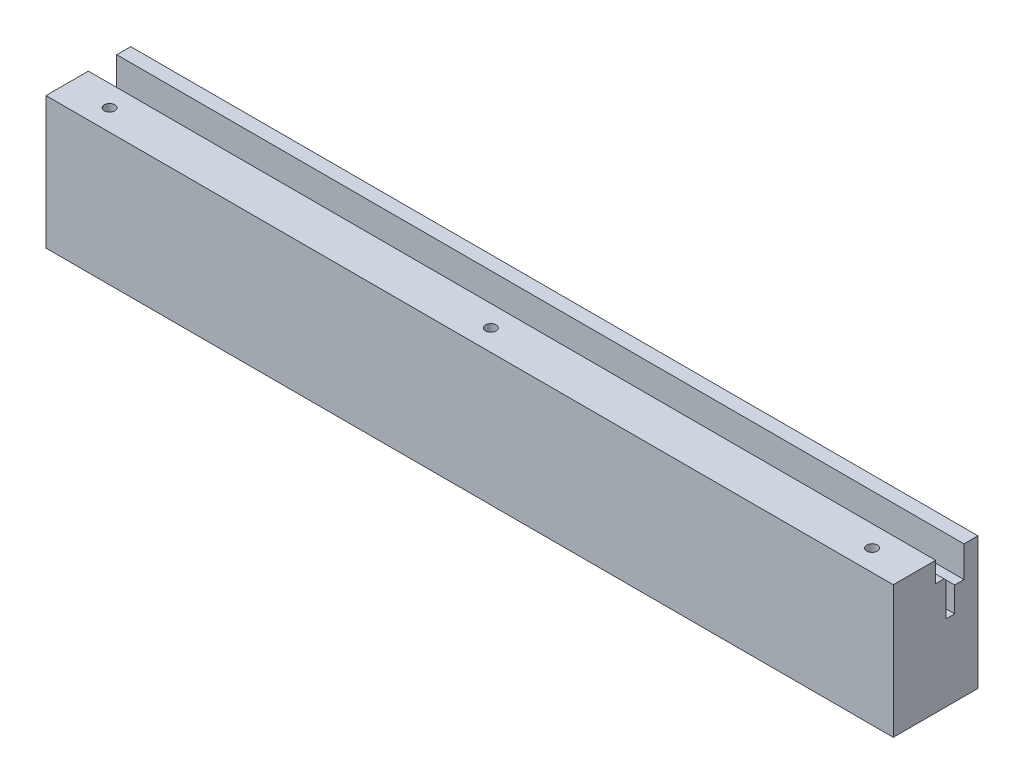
from build123d import *

# Parameters (mm, degrees)
SKETCH_1_W          = 200
SKETCH_1_H          = 31.2
EXTRUDE_1_DEPTH     = 20
SKETCH_2_OUTSIDE_W  = 62.68
SKETCH_2_OUTSIDE_H  = 73.88
CUT_EXTRUDE_1_DEPTH = 204.404621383
SKETCH_3_R          = 1.25
CUT_EXTRUDE_2_DEPTH = 20
SKETCH_5_R          = 2.1
CUT_EXTRUDE_3_DEPTH = 20


with BuildPart() as part:
    # Sketch 1 → Extrude 1 (new body)
    with BuildSketch(Plane.XY):
        with Locations((100, 15.6)):
            Rectangle(SKETCH_1_W, SKETCH_1_H)
    extrude(amount=EXTRUDE_1_DEPTH)

    # Sketch 2 outside → Cut-Extrude 1 (cut, through all)
    with BuildSketch(Plane(origin=(200, 0, 0), x_dir=(0, 0, -1), z_dir=(1, 0, 0))):
        with Locations((-10, 15.6)):
            Rectangle(SKETCH_2_OUTSIDE_W, SKETCH_2_OUTSIDE_H)
        Polygon((-5.5, 18), (-5.5, 23.9), (-3.3, 23.9), (-3.3, 31.2), (0, 31.2), (0, 0), (-20, 0), (-20, 31.2), (-10, 31.2), (-10, 26.4), (-8, 26.4), (-7.5, 25.9), (-7.5, 18), align=None, mode=Mode.SUBTRACT)
    extrude(amount=-CUT_EXTRUDE_1_DEPTH, mode=Mode.SUBTRACT)

    # Sketch 3 → Cut-Extrude 2 (cut)
    with BuildSketch(Plane(origin=(0, 31.2, 0), x_dir=(1, 0, 0), z_dir=(0, 1, 0))):
        with Locations(Location((10, -15, 0), (0, 0, 270))):
            Circle(SKETCH_3_R)
        with Locations(Location((100, -15, 0), (0, 0, 270))):
            Circle(SKETCH_3_R)
        with Locations(Location((190, -15, 0), (0, 0, 270))):
            Circle(SKETCH_3_R)
    extrude(amount=-CUT_EXTRUDE_2_DEPTH, mode=Mode.SUBTRACT)

    # Sketch 5 → Cut-Extrude 3 (cut)
    with BuildSketch(Plane.XZ):
        with Locations(Location((132.4, 15, 0), (0, 0, 270))):
            Circle(SKETCH_5_R)
        with Locations(Location((180, 15, 0), (0, 0, 270))):
            Circle(SKETCH_5_R)
    extrude(amount=-CUT_EXTRUDE_3_DEPTH, mode=Mode.SUBTRACT)


solid = part.part
